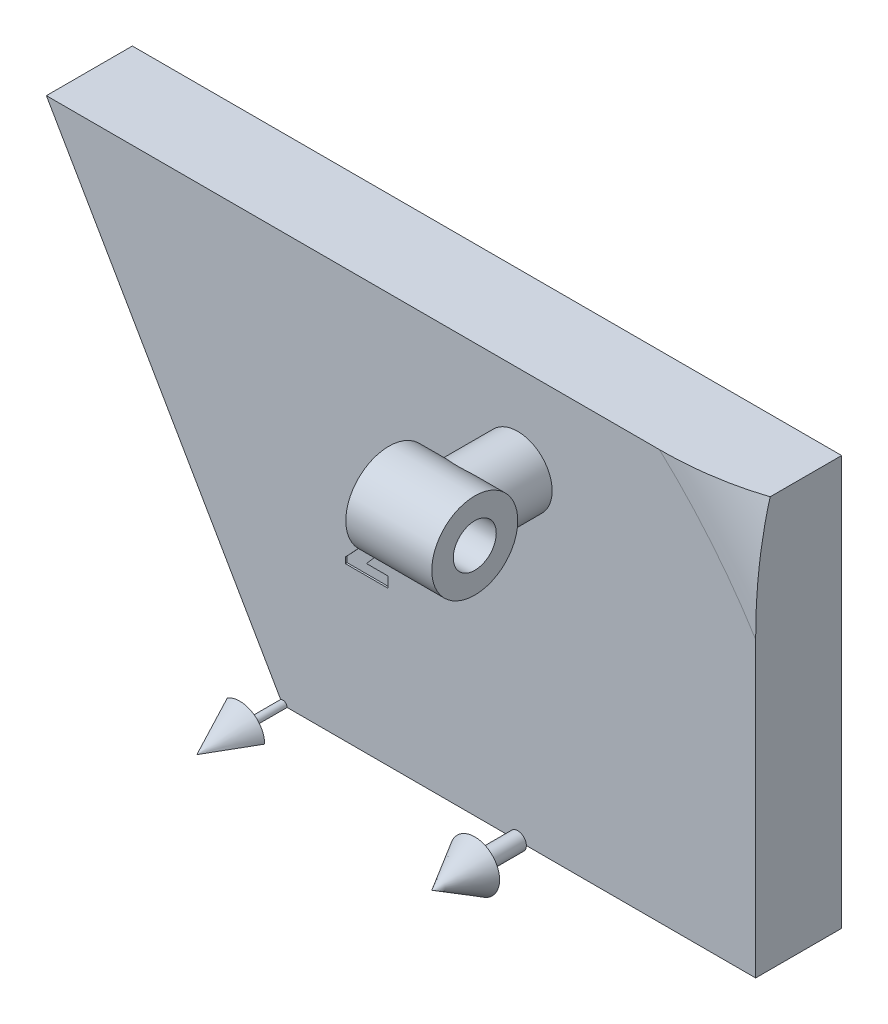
from build123d import *

# Parameters (mm, degrees)
BOSS_EXTRU_1_DEPTH      = 10
ESQUISSE3_R             = 5
ESQUISSE3_R_2           = 2.5
BOSS_EXTRU_2_DEPTH      = 5
BOSS_EXTRU_3_REACH      = 76.288
BOSS_EXTRU_3_END_RADIUS = 5
ESQUISSE4_R             = 4
R_VOLUTION1_ANGLE       = 120
ENL_V_MAT_EXTRU_2_DEPTH = 0.2


with BuildPart() as part:
    # Esquisse1 → Boss.-Extru.1 (new body)
    with BuildSketch(Plane.XY):
        Polygon((-27.5, 47.631397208), (55, 47.631397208), (55, 0), (0, 0), align=None)
    extrude(amount=BOSS_EXTRU_1_DEPTH)



with BuildPart() as body_2:
    # Esquisse3 → Boss.-Extru.2 (new, symmetric)
    with BuildSketch(Plane(origin=(27.33, 0, 0), x_dir=(0, 0, -1), z_dir=(1, 0, 0))):
        with Locations(Location((-20, 37.23, 0), (0, 0, 90))):
            Circle(ESQUISSE3_R)
        with Locations(Location((-20, 37.23, 0), (0, 0, 90))):
            Circle(ESQUISSE3_R_2, mode=Mode.SUBTRACT)
    extrude(amount=BOSS_EXTRU_2_DEPTH, both=True)


with BuildPart() as part_1:
    add(part.part)

    add(body_2.part)  # Boss.-Extru.3 merges body 2
    # Boss.-Extru.3: up to this cylinder (the profile starts outside it)
    boss_extru_3_end = Plane(origin=(27.33, 37.23, 20), z_dir=(-1, 0, 0)) * Cylinder(BOSS_EXTRU_3_END_RADIUS, 163.576, mode=Mode.PRIVATE)
    # Esquisse4 → Boss.-Extru.3 (add, up to the surface)
    with BuildSketch(Plane.XY.offset(10), mode=Mode.PRIVATE) as boss_extru_3_sk1:
        with Locations(Location((27.33, 37.23, 0), (0, 0, 180))):
            Circle(ESQUISSE4_R)
    boss_extru_3_tool1 = extrude(boss_extru_3_sk1.sketch, amount=BOSS_EXTRU_3_REACH, mode=Mode.PRIVATE) - boss_extru_3_end
    add(boss_extru_3_tool1.solids().sort_by_distance((27.33, 37.23, 10))[0])

    # Esquisse9 → R_volution1 (revolve)
    with BuildSketch(Plane.XZ):
        Polygon((0.5, 10), (0.5, 15), (2.886751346, 15), (0, 20), (0, 10), align=None)
    revolve(axis=Axis((0, 0, 10), (0, 0, 1)), revolution_arc=R_VOLUTION1_ANGLE)

    # Esquisse10 → R_volution2 (revolve)
    with BuildSketch(Plane(origin=(27.33, 0, 0), x_dir=(0, 0, -1), z_dir=(1, 0, 0))):
        Polygon((-10, 0), (-10, 1), (-15, 1), (-15, 2.886751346), (-20, 0), align=None)
    revolve(axis=Axis((27.33, 0, 10), (0, 0, 1)))

    # Esquisse8 → Enl_v. mat.-Extru.2 (cut)
    with BuildSketch(Plane.XY.offset(10)):
        with BuildLine():
            Line((8.799167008, 22.817321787), (7.469466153, 22.817321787))
            add(Edge.make_bspline(
                [(7.469466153, 22.817321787), (7.475208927, 22.917906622), (7.486429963, 23.114443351), (7.531064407, 23.399919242), (7.59087303, 23.669662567), (7.670695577, 23.922729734), (7.770997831, 24.159028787), (7.889198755, 24.379365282), (8.028318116, 24.582579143), (8.185394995, 24.767690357), (8.357762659, 24.933755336), (8.541842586, 25.080998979), (8.740450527, 25.202500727), (8.949957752, 25.302485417), (9.170328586, 25.382368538), (9.403648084, 25.435776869), (9.64789604, 25.471945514), (9.815103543, 25.475110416), (9.900325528, 25.476723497)],
                knots=[0, 0, 0, 0, 1.199038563, 2.342849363, 3.436047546, 4.486744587, 5.497670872, 6.488682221, 7.459191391, 8.424610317, 9.374430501, 10.305433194, 11.225809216, 12.140057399, 13.06607119, 14.010487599, 14.985989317, 16, 16, 16, 16], degree=3))
            add(Edge.make_bspline(
                [(9.900325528, 25.476723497), (10.004934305, 25.473459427), (10.209155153, 25.467087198), (10.505904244, 25.412729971), (10.783035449, 25.32180911), (11.04034732, 25.194768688), (11.275649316, 25.03337715), (11.488902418, 24.840944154), (11.673657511, 24.613432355), (11.831085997, 24.360308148), (11.961890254, 24.092285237), (12.053552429, 23.815138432), (12.11380099, 23.536222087), (12.120226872, 23.348413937), (12.123419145, 23.255113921)],
                knots=[0, 0, 0, 0, 1.075374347, 2.099382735, 3.09057751, 4.06680945, 5.040638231, 6.016817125, 7.011024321, 8.044445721, 9.0776792, 10.070479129, 11.0414456, 12, 12, 12, 12], degree=3))
            add(Edge.make_bspline(
                [(12.123419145, 23.255113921), (12.122176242, 23.198679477), (12.119674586, 23.085090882), (12.102280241, 22.913203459), (12.076185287, 22.738116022), (12.036840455, 22.559978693), (11.987774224, 22.378741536), (11.928249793, 22.193862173), (11.856886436, 22.006388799), (11.774875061, 21.814211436), (11.677035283, 21.616706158), (11.563114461, 21.410912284), (11.430088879, 21.19701237), (11.279565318, 20.973798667), (11.11081272, 20.741623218), (10.923007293, 20.501185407), (10.718312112, 20.251638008), (10.573034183, 20.084829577), (10.498394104, 19.999127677)],
                knots=[0, 0, 0, 0, 0.728284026, 1.46585585, 2.227944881, 3.01186502, 3.81876927, 4.650621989, 5.517437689, 6.406905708, 7.346299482, 8.360816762, 9.441613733, 10.596154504, 11.834900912, 13.145207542, 14.533280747, 16, 16, 16, 16], degree=3))
            Line((10.498394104, 19.999127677), (9.725208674, 19.113155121))
            Line((9.725208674, 19.113155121), (12.218397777, 19.113155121))
            Line((12.218397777, 19.113155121), (12.218397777, 17.878432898))
            Line((12.218397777, 17.878432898), (7.279508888, 17.878432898))
            Line((7.279508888, 17.878432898), (7.279508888, 18.552187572))
            Line((7.279508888, 18.552187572), (9.472921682, 20.886584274))
            add(Edge.make_bspline(
                [(9.472921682, 20.886584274), (9.536426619, 20.954679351), (9.659416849, 21.08655932), (9.834419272, 21.280239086), (9.992781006, 21.46403656), (10.131218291, 21.639908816), (10.256996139, 21.802151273), (10.364506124, 21.955654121), (10.45473188, 22.099029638), (10.552684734, 22.271915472), (10.645707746, 22.478112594), (10.73106199, 22.715660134), (10.783091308, 22.942700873), (10.790273, 23.090645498), (10.79371829, 23.16161933)],
                knots=[0, 0, 0, 0, 1.246127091, 2.413378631, 3.493388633, 4.492180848, 5.408488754, 6.240484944, 6.999099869, 7.674939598, 8.898438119, 10.020720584, 11.050475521, 12, 12, 12, 12], degree=3))
            add(Edge.make_bspline(
                [(10.79371829, 23.16161933), (10.79114233, 23.230281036), (10.786150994, 23.363324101), (10.731300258, 23.552577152), (10.646323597, 23.72392647), (10.526579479, 23.872251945), (10.381531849, 23.994140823), (10.213915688, 24.084798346), (10.02509756, 24.137107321), (9.892732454, 24.143654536), (9.82463943, 24.147022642)],
                knots=[0, 0, 0, 0, 1.062038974, 2.057870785, 3.028805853, 4.01125022, 4.991535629, 5.949134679, 6.94496649, 8, 8, 8, 8], degree=3))
            add(Edge.make_bspline(
                [(9.82463943, 24.147022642), (9.789461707, 24.145778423), (9.720208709, 24.143328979), (9.618412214, 24.127023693), (9.521545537, 24.098287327), (9.428530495, 24.059784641), (9.340359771, 24.008749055), (9.257255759, 23.945839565), (9.178342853, 23.872654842), (9.10398298, 23.789423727), (9.036305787, 23.696537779), (8.976195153, 23.594845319), (8.926493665, 23.484409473), (8.882734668, 23.366688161), (8.848985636, 23.240416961), (8.824412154, 23.106351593), (8.805730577, 22.964710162), (8.801394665, 22.867344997), (8.799167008, 22.817321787)],
                knots=[0, 0, 0, 0, 0.903469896, 1.778625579, 2.63899355, 3.493148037, 4.358286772, 5.247621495, 6.164656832, 7.118446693, 8.109501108, 9.111810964, 10.146451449, 11.215617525, 12.33435995, 13.498009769, 14.714554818, 16, 16, 16, 16], degree=3))
        make_face()
    extrude(amount=-ENL_V_MAT_EXTRU_2_DEPTH, mode=Mode.SUBTRACT)

    # Esquisse11 → Enl_vement de mati_re-R_volution1 (revolve, cut)
    with BuildSketch(Plane(origin=(0, 0, 0), x_dir=(0.866025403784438, 0.500000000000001, 0), z_dir=(0.500000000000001, -0.866025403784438, 0))):
        with BuildLine():
            Line((64.715728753, 10), (64.715728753, 14.356618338))
            Line((64.715728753, 14.356618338), (78.857864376, 14.356618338))
            Line((78.857864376, 14.356618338), (78.857864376, 4.142135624))
            ThreePointArc((78.857864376, 4.142135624), (72.3693974, 8.47759065), (64.715728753, 10))
        make_face()
    revolve(axis=Axis((0, 0, 0), (0, 0, 1)), mode=Mode.SUBTRACT)


solid = part_1.part
